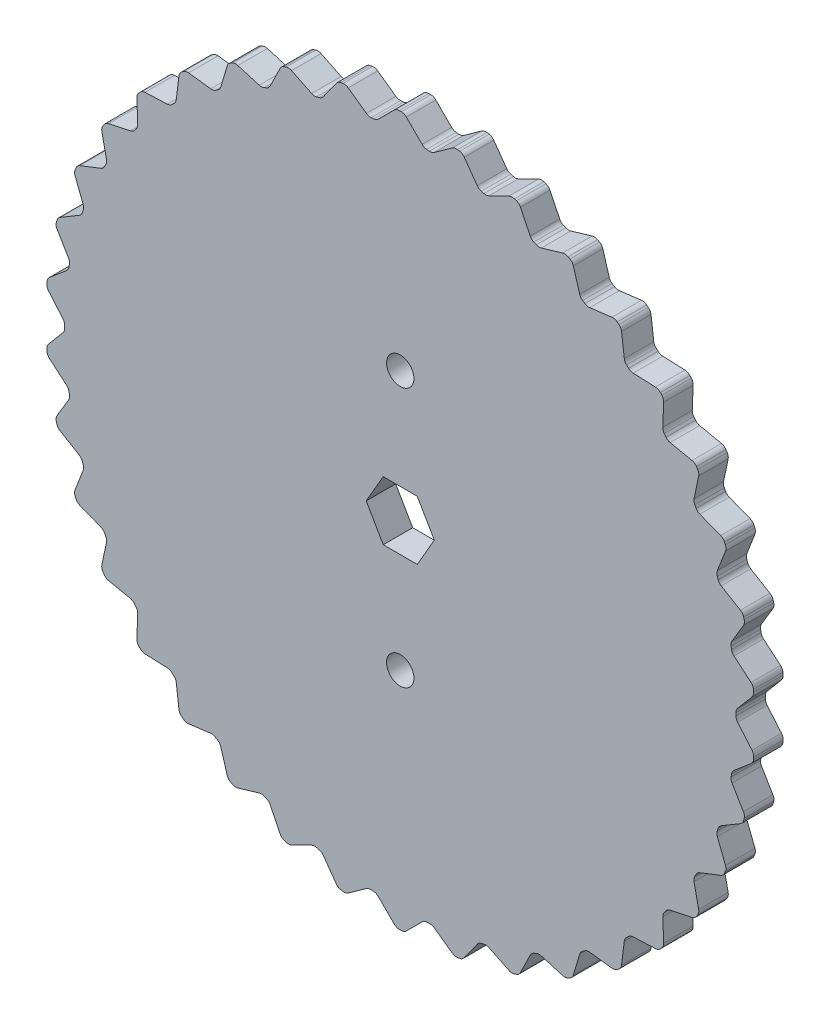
from build123d import *

# Parameters (mm, degrees)
BOSS_EXTRUDE1_DEPTH      = 3.175
SKETCH3_R                = 36.14212445
BOSS_EXTRUDE2_DEPTH      = 3.175
FILLET1_R                = 0.762
CIRPATTERN1_COUNT        = 38
FILLET1_OF_CIRPATTERN1_R = 0.762
CUT_EXTRUDE1_DEPTH       = 54.996284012
F_4_CLEARANCE_HOLE1_D    = 2.9464


with BuildPart() as part:
    # Sketch2 → Boss-Extrude1 (new body)
    with BuildSketch(Plane.XY):
        with BuildLine():
            Line((0.4318, 38.17412445), (-0.4318, 38.17412445))
            Line((-0.4318, 38.17412445), (-2.554164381, 36.051760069))
            ThreePointArc((-2.554164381, 36.051760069), (-2.769477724, 36.035859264), (-2.984692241, 36.018672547))
            ThreePointArc((-2.984692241, 36.018672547), (0, 33.154880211), (2.984692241, 36.018672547))
            ThreePointArc((2.984692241, 36.018672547), (2.769477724, 36.035859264), (2.554164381, 36.051760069))
            Line((2.554164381, 36.051760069), (0.4318, 38.17412445))
        make_face()
    boss_extrude1 = extrude(amount=BOSS_EXTRUDE1_DEPTH)

    # Sketch3 → Boss-Extrude2 (add)
    with BuildSketch(Plane.XY):
        Circle(SKETCH3_R)
    extrude(amount=BOSS_EXTRUDE2_DEPTH)

    # Fillet1
    fillet1_edges = [part.edges().sort_by_distance(p)[0] for p in [
        (-2.554164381, 36.051760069, 1.5875),
        (-0.4318, 38.17412445, 1.5875),
        (0.4318, 38.17412445, 1.5875),
        (2.554164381, 36.051760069, 1.5875),
    ]]
    fillet(fillet1_edges, radius=FILLET1_R)

    # CirPattern1: Boss-Extrude1 ×38 about axis
    cirpattern1_axis = Axis((0, 0, 0), (0, 0, 1))
    for i in range(1, CIRPATTERN1_COUNT):
        add(boss_extrude1.rotate(cirpattern1_axis, i * 360 / CIRPATTERN1_COUNT))

    # Fillet1 of CirPattern1
    fillet1_of_cirpattern1_edges = [part.edges().sort_by_distance(p)[0] for p in [
        (-8.453253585, 35.139659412, 1.5875),
        (-6.709165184, 37.582407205, 1.5875),
        (-5.857343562, 37.724551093, 1.5875),
        (-3.41459577, 35.980462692, 1.5875),
        (-14.121760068, 33.269040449, 1.5875),
        (-12.803521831, 35.965539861, 1.5875),
        (-11.986714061, 36.245950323, 1.5875),
        (-9.290214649, 34.927712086, 1.5875),
        (-19.405061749, 30.490928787, 1.5875),
        (-18.548631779, 33.367626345, 1.5875),
        (-17.789118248, 33.778654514, 1.5875),
        (-14.91242069, 32.922224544, 1.5875),
        (-24.15904393, 26.881104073, 1.5875),
        (-23.787783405, 29.859530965, 1.5875),
        (-23.106281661, 30.389965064, 1.5875),
        (-20.127854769, 30.018704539, 1.5875),
        (-28.254030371, 22.538032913, 1.5875),
        (-28.37806631, 25.536945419, 1.5875),
        (-27.793165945, 26.172316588, 1.5875),
        (-24.794253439, 26.296352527, 1.5875),
        (-31.578320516, 17.580182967, 1.5875),
        (-32.194269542, 20.517778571, 1.5875),
        (-31.721925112, 21.240755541, 1.5875),
        (-28.784329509, 21.856704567, 1.5875),
        (-34.041236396, 12.142791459, 1.5875),
        (-35.132297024, 14.938940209, 1.5875),
        (-34.785392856, 15.729802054, 1.5875),
        (-31.989244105, 16.820862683, 1.5875),
        (-35.575596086, 6.374176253, 1.5875),
        (-37.112007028, 8.952606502, 1.5875),
        (-36.900005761, 9.789780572, 1.5875),
        (-34.321575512, 11.326191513, 1.5875),
        (-36.139546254, 0.431690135, 1.5875),
        (-38.079398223, 2.722069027, 1.5875),
        (-38.0080827, 3.582719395, 1.5875),
        (-35.717703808, 5.522571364, 1.5875),
        (-35.717703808, -5.522571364, 1.5875),
        (-38.0080827, -3.582719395, 1.5875),
        (-38.079398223, -2.722069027, 1.5875),
        (-36.139546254, -0.431690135, 1.5875),
        (-34.321575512, -11.326191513, 1.5875),
        (-36.900005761, -9.789780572, 1.5875),
        (-37.112007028, -8.952606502, 1.5875),
        (-35.575596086, -6.374176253, 1.5875),
        (-31.989244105, -16.820862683, 1.5875),
        (-34.785392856, -15.729802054, 1.5875),
        (-35.132297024, -14.938940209, 1.5875),
        (-34.041236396, -12.142791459, 1.5875),
        (-28.784329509, -21.856704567, 1.5875),
        (-31.721925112, -21.240755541, 1.5875),
        (-32.194269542, -20.517778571, 1.5875),
        (-31.578320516, -17.580182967, 1.5875),
        (-24.794253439, -26.296352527, 1.5875),
        (-27.793165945, -26.172316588, 1.5875),
        (-28.37806631, -25.536945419, 1.5875),
        (-28.254030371, -22.538032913, 1.5875),
        (-20.127854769, -30.018704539, 1.5875),
        (-23.106281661, -30.389965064, 1.5875),
        (-23.787783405, -29.859530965, 1.5875),
        (-24.15904393, -26.881104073, 1.5875),
        (-14.91242069, -32.922224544, 1.5875),
        (-17.789118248, -33.778654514, 1.5875),
        (-18.548631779, -33.367626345, 1.5875),
        (-19.405061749, -30.490928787, 1.5875),
        (-9.290214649, -34.927712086, 1.5875),
        (-11.986714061, -36.245950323, 1.5875),
        (-12.803521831, -35.965539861, 1.5875),
        (-14.121760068, -33.269040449, 1.5875),
        (-3.41459577, -35.980462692, 1.5875),
        (-5.857343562, -37.724551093, 1.5875),
        (-6.709165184, -37.582407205, 1.5875),
        (-8.453253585, -35.139659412, 1.5875),
        (2.554164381, -36.051760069, 1.5875),
        (0.4318, -38.17412445, 1.5875),
        (-0.4318, -38.17412445, 1.5875),
        (-2.554164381, -36.051760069, 1.5875),
        (8.453253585, -35.139659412, 1.5875),
        (6.709165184, -37.582407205, 1.5875),
        (5.857343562, -37.724551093, 1.5875),
        (3.41459577, -35.980462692, 1.5875),
        (14.121760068, -33.269040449, 1.5875),
        (12.803521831, -35.965539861, 1.5875),
        (11.986714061, -36.245950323, 1.5875),
        (9.290214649, -34.927712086, 1.5875),
        (19.405061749, -30.490928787, 1.5875),
        (18.548631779, -33.367626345, 1.5875),
        (17.789118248, -33.778654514, 1.5875),
        (14.91242069, -32.922224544, 1.5875),
        (24.15904393, -26.881104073, 1.5875),
        (23.787783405, -29.859530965, 1.5875),
        (23.106281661, -30.389965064, 1.5875),
        (20.127854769, -30.018704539, 1.5875),
        (28.254030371, -22.538032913, 1.5875),
        (28.37806631, -25.536945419, 1.5875),
        (27.793165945, -26.172316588, 1.5875),
        (24.794253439, -26.296352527, 1.5875),
        (31.578320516, -17.580182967, 1.5875),
        (32.194269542, -20.517778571, 1.5875),
        (31.721925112, -21.240755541, 1.5875),
        (28.784329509, -21.856704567, 1.5875),
        (34.041236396, -12.142791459, 1.5875),
        (35.132297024, -14.938940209, 1.5875),
        (34.785392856, -15.729802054, 1.5875),
        (31.989244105, -16.820862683, 1.5875),
        (35.575596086, -6.374176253, 1.5875),
        (37.112007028, -8.952606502, 1.5875),
        (36.900005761, -9.789780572, 1.5875),
        (34.321575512, -11.326191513, 1.5875),
        (36.139546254, -0.431690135, 1.5875),
        (38.079398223, -2.722069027, 1.5875),
        (38.0080827, -3.582719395, 1.5875),
        (35.717703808, -5.522571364, 1.5875),
        (35.717703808, 5.522571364, 1.5875),
        (38.0080827, 3.582719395, 1.5875),
        (38.079398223, 2.722069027, 1.5875),
        (36.139546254, 0.431690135, 1.5875),
        (34.321575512, 11.326191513, 1.5875),
        (36.900005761, 9.789780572, 1.5875),
        (37.112007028, 8.952606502, 1.5875),
        (35.575596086, 6.374176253, 1.5875),
        (31.989244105, 16.820862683, 1.5875),
        (34.785392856, 15.729802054, 1.5875),
        (35.132297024, 14.938940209, 1.5875),
        (34.041236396, 12.142791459, 1.5875),
        (28.784329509, 21.856704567, 1.5875),
        (31.721925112, 21.240755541, 1.5875),
        (32.194269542, 20.517778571, 1.5875),
        (31.578320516, 17.580182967, 1.5875),
        (24.794253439, 26.296352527, 1.5875),
        (27.793165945, 26.172316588, 1.5875),
        (28.37806631, 25.536945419, 1.5875),
        (28.254030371, 22.538032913, 1.5875),
        (20.127854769, 30.018704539, 1.5875),
        (23.106281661, 30.389965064, 1.5875),
        (23.787783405, 29.859530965, 1.5875),
        (24.15904393, 26.881104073, 1.5875),
        (14.91242069, 32.922224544, 1.5875),
        (17.789118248, 33.778654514, 1.5875),
        (18.548631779, 33.367626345, 1.5875),
        (19.405061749, 30.490928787, 1.5875),
        (9.290214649, 34.927712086, 1.5875),
        (11.986714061, 36.245950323, 1.5875),
        (12.803521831, 35.965539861, 1.5875),
        (14.121760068, 33.269040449, 1.5875),
        (3.41459577, 35.980462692, 1.5875),
        (5.857343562, 37.724551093, 1.5875),
        (6.709165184, 37.582407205, 1.5875),
        (8.453253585, 35.139659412, 1.5875),
    ]]
    fillet(fillet1_of_cirpattern1_edges, radius=FILLET1_OF_CIRPATTERN1_R)

    # Sketch4 → Cut-Extrude1 (cut, through all)
    with BuildSketch(Plane.XY.offset(3.175)):
        Polygon((1.833087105, -3.175), (3.666174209, 0), (1.833087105, 3.175), (-1.833087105, 3.175), (-3.666174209, 0), (-1.833087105, -3.175), align=None)
    extrude(amount=-CUT_EXTRUDE1_DEPTH, mode=Mode.SUBTRACT)

    # 4 Clearance Hole1 (through all)
    with Locations(Plane.XY.offset(3.175)):
        with Locations((0, 13.97), (0, -13.97)):
            Hole(F_4_CLEARANCE_HOLE1_D / 2)


solid = part.part
